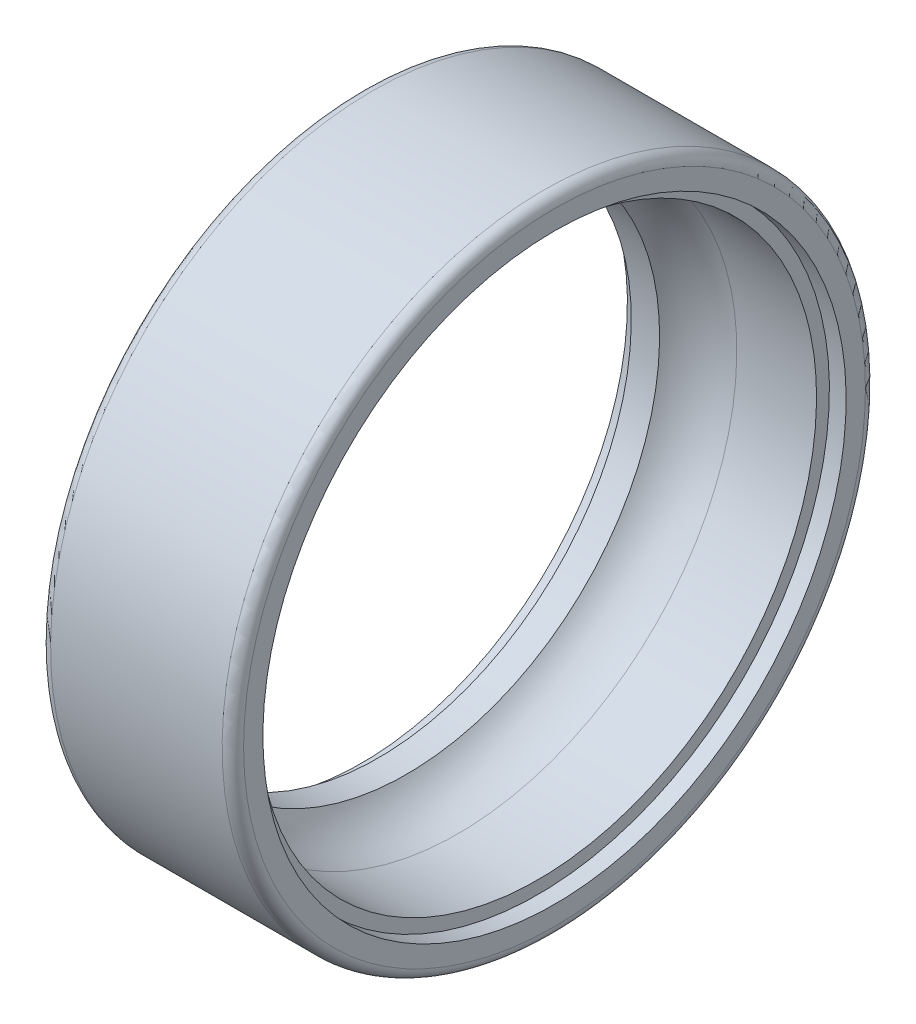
ISO-10303-21;
HEADER;
FILE_DESCRIPTION(('STEP AP214'),'2;1');
FILE_NAME('part.step','',(''),(''),'','','');
FILE_SCHEMA(('AUTOMOTIVE_DESIGN { 1 0 10303 214 1 1 1 1 }'));
ENDSEC;
DATA;
#1=APPLICATION_CONTEXT('core data for automotive mechanical design processes');
#2=APPLICATION_PROTOCOL_DEFINITION('international standard','automotive_design',2000,#1);
#3=PRODUCT_CONTEXT('',#1,'mechanical');
#4=PRODUCT('Part','Part','',(#3));
#5=PRODUCT_RELATED_PRODUCT_CATEGORY('part','',(#4));
#6=PRODUCT_DEFINITION_FORMATION('','',#4);
#7=PRODUCT_DEFINITION_CONTEXT('part definition',#1,'design');
#8=PRODUCT_DEFINITION('design','',#6,#7);
#9=PRODUCT_DEFINITION_SHAPE('','',#8);
#10=(LENGTH_UNIT() NAMED_UNIT(*) SI_UNIT(.MILLI.,.METRE.));
#11=(NAMED_UNIT(*) PLANE_ANGLE_UNIT() SI_UNIT($,.RADIAN.));
#12=(NAMED_UNIT(*) SI_UNIT($,.STERADIAN.) SOLID_ANGLE_UNIT());
#13=UNCERTAINTY_MEASURE_WITH_UNIT(LENGTH_MEASURE(1.E-05),#10,'distance_accuracy_value','');
#14=(GEOMETRIC_REPRESENTATION_CONTEXT(3) GLOBAL_UNCERTAINTY_ASSIGNED_CONTEXT((#13)) GLOBAL_UNIT_ASSIGNED_CONTEXT((#10,
#11,#12)) REPRESENTATION_CONTEXT('',''));
#15=CARTESIAN_POINT('',(0.,0.,0.));
#16=DIRECTION('',(0.,0.,1.));
#17=DIRECTION('',(1.,0.,0.));
#18=AXIS2_PLACEMENT_3D('',#15,#16,#17);
#19=CARTESIAN_POINT('',(0.,13.45,0.));
#20=DIRECTION('',(-1.,0.,0.));
#21=DIRECTION('',(0.,0.,1.));
#22=AXIS2_PLACEMENT_3D('',#19,#20,#21);
#23=PLANE('',#22);
#24=CARTESIAN_POINT('',(0.,0.,0.));
#25=DIRECTION('',(-1.,0.,0.));
#26=DIRECTION('',(0.,1.,0.));
#27=AXIS2_PLACEMENT_3D('',#24,#25,#26);
#28=CIRCLE('',#27,12.4);
#29=CARTESIAN_POINT('',(0.,12.4,0.));
#30=VERTEX_POINT('',#29);
#31=EDGE_CURVE('E39',#30,#30,#28,.T.);
#32=ORIENTED_EDGE('',*,*,#31,.F.);
#33=EDGE_LOOP('',(#32));
#34=FACE_BOUND('',#33,.T.);
#35=CARTESIAN_POINT('',(0.,0.,0.));
#36=DIRECTION('',(-1.,0.,0.));
#37=DIRECTION('',(0.,1.,0.));
#38=AXIS2_PLACEMENT_3D('',#35,#36,#37);
#39=CIRCLE('',#38,14.5);
#40=CARTESIAN_POINT('',(0.,14.5,0.));
#41=VERTEX_POINT('',#40);
#42=EDGE_CURVE('E10',#41,#41,#39,.T.);
#43=ORIENTED_EDGE('',*,*,#42,.T.);
#44=EDGE_LOOP('',(#43));
#45=FACE_BOUND('',#44,.T.);
#46=ADVANCED_FACE('F15',(#34,#45),#23,.T.);
#47=CARTESIAN_POINT('',(9.,14.05,0.));
#48=DIRECTION('',(1.,0.,0.));
#49=DIRECTION('',(0.,0.,-1.));
#50=AXIS2_PLACEMENT_3D('',#47,#48,#49);
#51=PLANE('',#50);
#52=CARTESIAN_POINT('',(9.,0.,0.));
#53=DIRECTION('',(-1.,0.,0.));
#54=DIRECTION('',(0.,1.,0.));
#55=AXIS2_PLACEMENT_3D('',#52,#53,#54);
#56=CIRCLE('',#55,13.6);
#57=CARTESIAN_POINT('',(9.,13.6,0.));
#58=VERTEX_POINT('',#57);
#59=EDGE_CURVE('E24',#58,#58,#56,.T.);
#60=ORIENTED_EDGE('',*,*,#59,.T.);
#61=EDGE_LOOP('',(#60));
#62=FACE_BOUND('',#61,.T.);
#63=CARTESIAN_POINT('',(9.,0.,0.));
#64=DIRECTION('',(-1.,0.,0.));
#65=DIRECTION('',(0.,1.,0.));
#66=AXIS2_PLACEMENT_3D('',#63,#64,#65);
#67=CIRCLE('',#66,14.5);
#68=CARTESIAN_POINT('',(9.,14.5,0.));
#69=VERTEX_POINT('',#68);
#70=EDGE_CURVE('E56',#69,#69,#67,.T.);
#71=ORIENTED_EDGE('',*,*,#70,.F.);
#72=EDGE_LOOP('',(#71));
#73=FACE_BOUND('',#72,.T.);
#74=ADVANCED_FACE('F104',(#62,#73),#51,.T.);
#75=CARTESIAN_POINT('',(8.22,13.3,0.));
#76=DIRECTION('',(1.,0.,0.));
#77=DIRECTION('',(0.,0.,-1.));
#78=AXIS2_PLACEMENT_3D('',#75,#76,#77);
#79=PLANE('',#78);
#80=CARTESIAN_POINT('',(8.22,0.,0.));
#81=DIRECTION('',(-1.,0.,0.));
#82=DIRECTION('',(0.,1.,0.));
#83=AXIS2_PLACEMENT_3D('',#80,#81,#82);
#84=CIRCLE('',#83,13.);
#85=CARTESIAN_POINT('',(8.22,13.,0.));
#86=VERTEX_POINT('',#85);
#87=EDGE_CURVE('E34',#86,#86,#84,.T.);
#88=ORIENTED_EDGE('',*,*,#87,.T.);
#89=EDGE_LOOP('',(#88));
#90=FACE_BOUND('',#89,.T.);
#91=CARTESIAN_POINT('',(8.22,0.,0.));
#92=DIRECTION('',(-1.,0.,0.));
#93=DIRECTION('',(0.,1.,0.));
#94=AXIS2_PLACEMENT_3D('',#91,#92,#93);
#95=CIRCLE('',#94,13.6);
#96=CARTESIAN_POINT('',(8.22,13.6,0.));
#97=VERTEX_POINT('',#96);
#98=EDGE_CURVE('E52',#97,#97,#95,.T.);
#99=ORIENTED_EDGE('',*,*,#98,.F.);
#100=EDGE_LOOP('',(#99));
#101=FACE_BOUND('',#100,.T.);
#102=ADVANCED_FACE('F110',(#90,#101),#79,.T.);
#103=CARTESIAN_POINT('',(0.78,12.1,0.));
#104=DIRECTION('',(-1.,0.,0.));
#105=DIRECTION('',(0.,0.,1.));
#106=AXIS2_PLACEMENT_3D('',#103,#104,#105);
#107=PLANE('',#106);
#108=CARTESIAN_POINT('',(0.78,0.,0.));
#109=DIRECTION('',(-1.,0.,0.));
#110=DIRECTION('',(0.,1.,0.));
#111=AXIS2_PLACEMENT_3D('',#108,#109,#110);
#112=CIRCLE('',#111,11.8);
#113=CARTESIAN_POINT('',(0.78,11.8,0.));
#114=VERTEX_POINT('',#113);
#115=EDGE_CURVE('E43',#114,#114,#112,.T.);
#116=ORIENTED_EDGE('',*,*,#115,.F.);
#117=EDGE_LOOP('',(#116));
#118=FACE_BOUND('',#117,.T.);
#119=CARTESIAN_POINT('',(0.78,0.,0.));
#120=DIRECTION('',(-1.,0.,0.));
#121=DIRECTION('',(0.,1.,0.));
#122=AXIS2_PLACEMENT_3D('',#119,#120,#121);
#123=CIRCLE('',#122,12.4);
#124=CARTESIAN_POINT('',(0.78,12.4,0.));
#125=VERTEX_POINT('',#124);
#126=EDGE_CURVE('E44',#125,#125,#123,.T.);
#127=ORIENTED_EDGE('',*,*,#126,.T.);
#128=EDGE_LOOP('',(#127));
#129=FACE_BOUND('',#128,.T.);
#130=ADVANCED_FACE('F74',(#118,#129),#107,.T.);
#131=CARTESIAN_POINT('',(0.39,0.,0.));
#132=DIRECTION('',(-1.,0.,0.));
#133=DIRECTION('',(0.,0.,1.));
#134=AXIS2_PLACEMENT_3D('',#131,#132,#133);
#135=CYLINDRICAL_SURFACE('',#134,12.4);
#136=ORIENTED_EDGE('',*,*,#126,.F.);
#137=EDGE_LOOP('',(#136));
#138=FACE_BOUND('',#137,.T.);
#139=ORIENTED_EDGE('',*,*,#31,.T.);
#140=EDGE_LOOP('',(#139));
#141=FACE_BOUND('',#140,.T.);
#142=ADVANCED_FACE('F88',(#138,#141),#135,.F.);
#143=CARTESIAN_POINT('',(1.44,0.,0.));
#144=DIRECTION('',(-1.,0.,0.));
#145=DIRECTION('',(0.,0.,1.));
#146=AXIS2_PLACEMENT_3D('',#143,#144,#145);
#147=CYLINDRICAL_SURFACE('',#146,11.8);
#148=CARTESIAN_POINT('',(2.1,0.,0.));
#149=DIRECTION('',(-1.,0.,0.));
#150=DIRECTION('',(0.,1.,0.));
#151=AXIS2_PLACEMENT_3D('',#148,#149,#150);
#152=CIRCLE('',#151,11.8);
#153=CARTESIAN_POINT('',(2.1,11.8,0.));
#154=VERTEX_POINT('',#153);
#155=EDGE_CURVE('E48',#154,#154,#152,.T.);
#156=ORIENTED_EDGE('',*,*,#155,.F.);
#157=EDGE_LOOP('',(#156));
#158=FACE_BOUND('',#157,.T.);
#159=ORIENTED_EDGE('',*,*,#115,.T.);
#160=EDGE_LOOP('',(#159));
#161=FACE_BOUND('',#160,.T.);
#162=ADVANCED_FACE('F72',(#158,#161),#147,.F.);
#163=CARTESIAN_POINT('',(4.5,0.,0.));
#164=DIRECTION('',(-1.,0.,0.));
#165=DIRECTION('',(0.,0.,1.));
#166=AXIS2_PLACEMENT_3D('',#163,#164,#165);
#167=TOROIDAL_SURFACE('',#166,10.,3.);
#168=ORIENTED_EDGE('',*,*,#155,.T.);
#169=EDGE_LOOP('',(#168));
#170=FACE_BOUND('',#169,.T.);
#171=CARTESIAN_POINT('',(4.5,0.,0.));
#172=DIRECTION('',(-1.,0.,0.));
#173=DIRECTION('',(0.,1.,0.));
#174=AXIS2_PLACEMENT_3D('',#171,#172,#173);
#175=CIRCLE('',#174,13.);
#176=CARTESIAN_POINT('',(4.5,13.,0.));
#177=VERTEX_POINT('',#176);
#178=EDGE_CURVE('E51',#177,#177,#175,.T.);
#179=ORIENTED_EDGE('',*,*,#178,.F.);
#180=EDGE_LOOP('',(#179));
#181=FACE_BOUND('',#180,.T.);
#182=ADVANCED_FACE('F67',(#170,#181),#167,.F.);
#183=CARTESIAN_POINT('',(6.36,0.,0.));
#184=DIRECTION('',(-1.,0.,0.));
#185=DIRECTION('',(0.,0.,1.));
#186=AXIS2_PLACEMENT_3D('',#183,#184,#185);
#187=CYLINDRICAL_SURFACE('',#186,13.);
#188=ORIENTED_EDGE('',*,*,#87,.F.);
#189=EDGE_LOOP('',(#188));
#190=FACE_BOUND('',#189,.T.);
#191=ORIENTED_EDGE('',*,*,#178,.T.);
#192=EDGE_LOOP('',(#191));
#193=FACE_BOUND('',#192,.T.);
#194=ADVANCED_FACE('F71',(#190,#193),#187,.F.);
#195=CARTESIAN_POINT('',(8.61,0.,0.));
#196=DIRECTION('',(-1.,0.,0.));
#197=DIRECTION('',(0.,0.,1.));
#198=AXIS2_PLACEMENT_3D('',#195,#196,#197);
#199=CYLINDRICAL_SURFACE('',#198,13.6);
#200=ORIENTED_EDGE('',*,*,#59,.F.);
#201=EDGE_LOOP('',(#200));
#202=FACE_BOUND('',#201,.T.);
#203=ORIENTED_EDGE('',*,*,#98,.T.);
#204=EDGE_LOOP('',(#203));
#205=FACE_BOUND('',#204,.T.);
#206=ADVANCED_FACE('F17',(#202,#205),#199,.F.);
#207=CARTESIAN_POINT('',(8.5,0.,0.));
#208=DIRECTION('',(-1.,0.,0.));
#209=DIRECTION('',(0.,0.,1.));
#210=AXIS2_PLACEMENT_3D('',#207,#208,#209);
#211=TOROIDAL_SURFACE('',#210,14.5,0.500000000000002);
#212=ORIENTED_EDGE('',*,*,#70,.T.);
#213=EDGE_LOOP('',(#212));
#214=FACE_BOUND('',#213,.T.);
#215=CARTESIAN_POINT('',(8.5,0.,0.));
#216=DIRECTION('',(-1.,0.,0.));
#217=DIRECTION('',(0.,1.,0.));
#218=AXIS2_PLACEMENT_3D('',#215,#216,#217);
#219=CIRCLE('',#218,15.);
#220=CARTESIAN_POINT('',(8.5,15.,0.));
#221=VERTEX_POINT('',#220);
#222=EDGE_CURVE('E135',#221,#221,#219,.T.);
#223=ORIENTED_EDGE('',*,*,#222,.F.);
#224=EDGE_LOOP('',(#223));
#225=FACE_BOUND('',#224,.T.);
#226=ADVANCED_FACE('F76',(#214,#225),#211,.T.);
#227=CARTESIAN_POINT('',(4.5,0.,0.));
#228=DIRECTION('',(-1.,0.,0.));
#229=DIRECTION('',(0.,0.,1.));
#230=AXIS2_PLACEMENT_3D('',#227,#228,#229);
#231=CYLINDRICAL_SURFACE('',#230,15.);
#232=CARTESIAN_POINT('',(0.5,0.,0.));
#233=DIRECTION('',(-1.,0.,0.));
#234=DIRECTION('',(0.,1.,0.));
#235=AXIS2_PLACEMENT_3D('',#232,#233,#234);
#236=CIRCLE('',#235,15.);
#237=CARTESIAN_POINT('',(0.5,15.,0.));
#238=VERTEX_POINT('',#237);
#239=EDGE_CURVE('E63',#238,#238,#236,.T.);
#240=ORIENTED_EDGE('',*,*,#239,.F.);
#241=EDGE_LOOP('',(#240));
#242=FACE_BOUND('',#241,.T.);
#243=ORIENTED_EDGE('',*,*,#222,.T.);
#244=EDGE_LOOP('',(#243));
#245=FACE_BOUND('',#244,.T.);
#246=ADVANCED_FACE('F79',(#242,#245),#231,.T.);
#247=CARTESIAN_POINT('',(0.500000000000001,0.,0.));
#248=DIRECTION('',(-1.,0.,0.));
#249=DIRECTION('',(0.,0.,1.));
#250=AXIS2_PLACEMENT_3D('',#247,#248,#249);
#251=TOROIDAL_SURFACE('',#250,14.5,0.500000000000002);
#252=ORIENTED_EDGE('',*,*,#239,.T.);
#253=EDGE_LOOP('',(#252));
#254=FACE_BOUND('',#253,.T.);
#255=ORIENTED_EDGE('',*,*,#42,.F.);
#256=EDGE_LOOP('',(#255));
#257=FACE_BOUND('',#256,.T.);
#258=ADVANCED_FACE('F83',(#254,#257),#251,.T.);
#259=CLOSED_SHELL('',(#46,#74,#102,#130,#142,#162,#182,#194,#206,#226,#246,#258));
#260=MANIFOLD_SOLID_BREP('B1',#259);
#261=ADVANCED_BREP_SHAPE_REPRESENTATION('',(#18,#260),#14);
#262=SHAPE_DEFINITION_REPRESENTATION(#9,#261);
ENDSEC;
END-ISO-10303-21;
